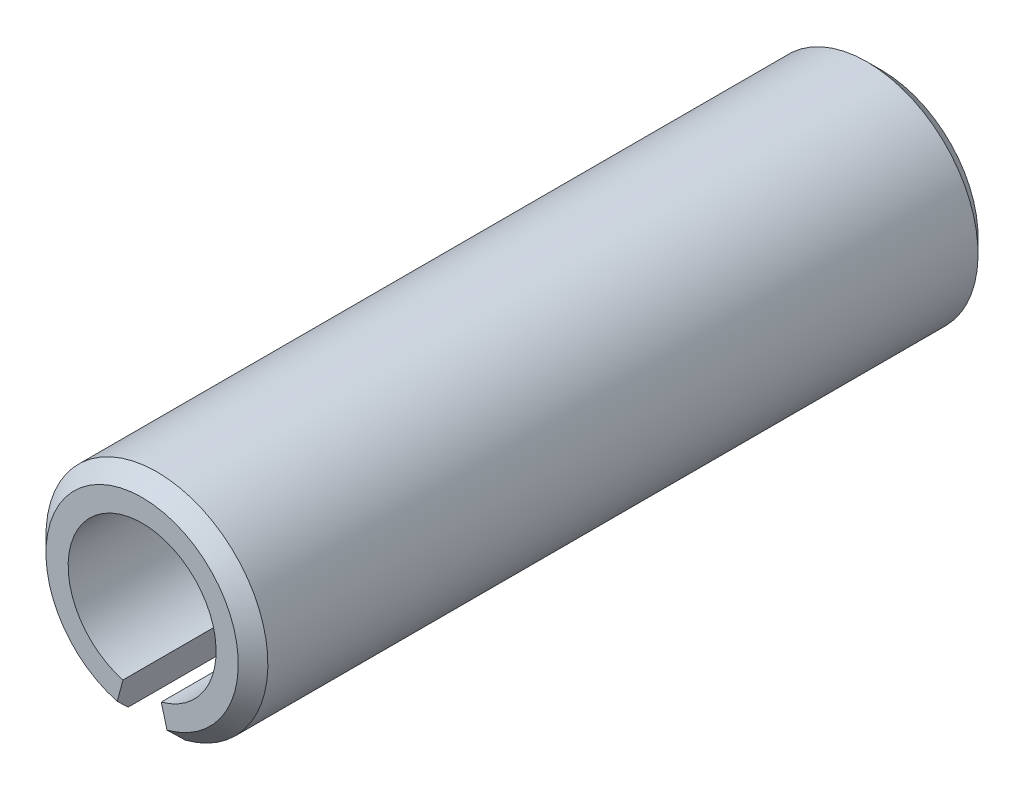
from build123d import *

# Parameters (mm, degrees)
BASE_EXTRUSION_DEPTH = 10
CHANFREIN1_SIZE      = 0.2


with BuildPart() as part:
    # Esquisse1 → Base-Extrusion (new body)
    with BuildSketch(Plane.XY):
        with BuildLine():
            Line((-0.258819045, -0.965925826), (-0.388228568, -1.448888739))
            ThreePointArc((-0.388228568, -1.448888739), (0, 1.5), (0.388228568, -1.448888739))
            Line((0.388228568, -1.448888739), (0.258819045, -0.965925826))
            ThreePointArc((0.258819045, -0.965925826), (0, 1), (-0.258819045, -0.965925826))
        make_face()
    extrude(amount=BASE_EXTRUSION_DEPTH)

    # Chanfrein1
    chanfrein1_edges = [part.edges().sort_by_distance(p)[0] for p in [
        (0, 1.5, 0),
        (0, 1.5, 10),
    ]]
    chamfer(chanfrein1_edges, length=CHANFREIN1_SIZE)


solid = part.part
